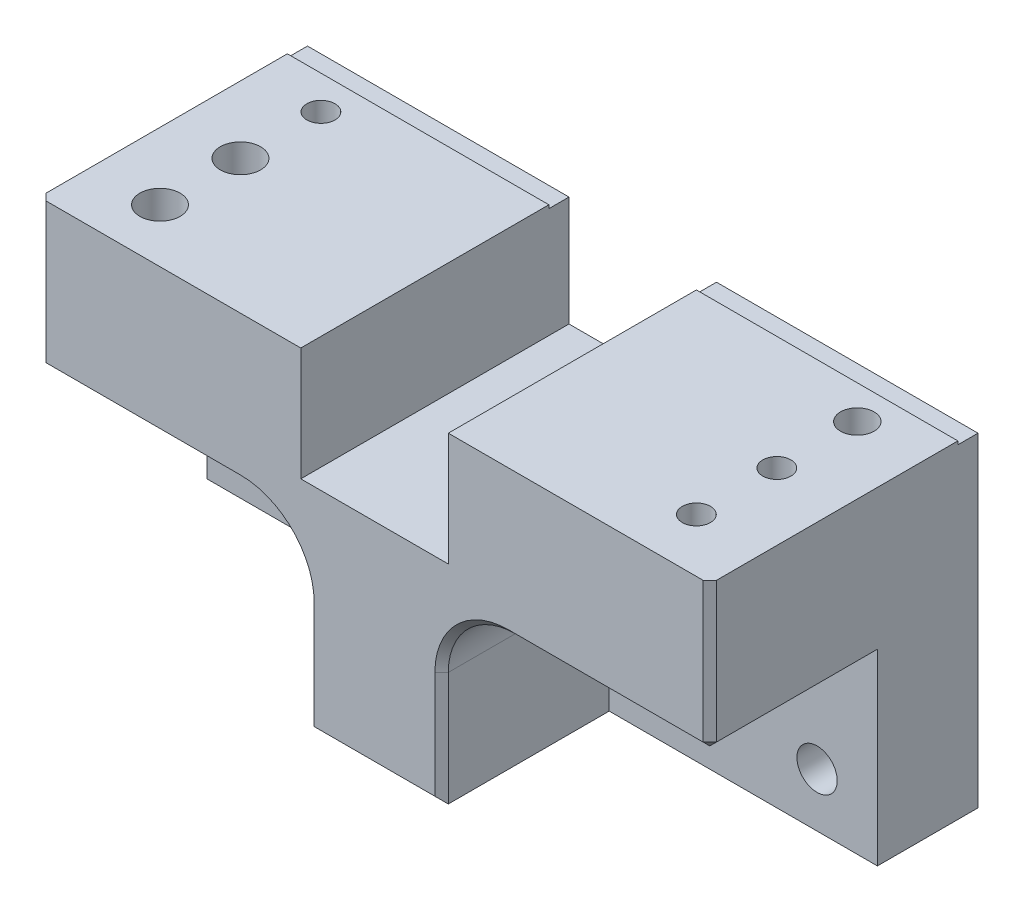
from build123d import *

# Parameters (mm, degrees)
EXTRUSION1_DEPTH                                = 40
ESQUISSE2_R                                     = 3.004
ESQUISSE2_R_2                                   = 2.5035
ENL_V_MAT_EXTRU_1_DEPTH                         = 15
TROU_TARAUD_M5X0_81_D                           = 4.2
TROU_TARAUD_M5X0_81_DEPTH                       = 12.4
TROU_TARAUD_M5X0_81_TIP                         = 1.2618073
ENL_V_MAT_EXTRU_2_DEPTH                         = 25
ESQUISSE5_W                                     = 100
ESQUISSE5_H                                     = 3
ENL_V_MAT_EXTRU_3_DEPTH                         = 0.5
ESQUISSE6_R                                     = 3.004
ENL_V_MAT_EXTRU_4_DEPTH                         = 75.271192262
CHAMBRAGE_POUR_VIS_T_TE_CYLINDRIQUE_D           = 5.5
CHAMBRAGE_POUR_VIS_T_TE_CYLINDRIQUE_CBORE_D     = 10
CHAMBRAGE_POUR_VIS_T_TE_CYLINDRIQUE_CBORE_DEPTH = 5
CHANFREIN1_SIZE                                 = 1


with BuildPart() as part:
    # Esquisse1 → Extrusion1 (new body)
    with BuildSketch(Plane.XY):
        Polygon((-50, 48.9), (-11, 48.9), (-11, 32), (11, 32), (11, 48.9), (50, 48.9), (50, 0), (-50, 0), align=None)
    extrude(amount=EXTRUSION1_DEPTH)

    # Esquisse2 → Enl_v. mat.-Extru.1 (cut)
    with BuildSketch(Plane(origin=(0, 48.9, 0), x_dir=(-1, 0, 0), z_dir=(0, 1, 0))):
        with Locations((40, 32)):
            Circle(ESQUISSE2_R)
        with Locations((-40, 8)):
            Circle(ESQUISSE2_R_2)
        with Locations((40, 20)):
            Circle(ESQUISSE2_R)
    extrude(amount=-ENL_V_MAT_EXTRU_1_DEPTH, mode=Mode.SUBTRACT)

    # Trou taraud_ M5x0.81
    with Locations(Plane(origin=(-40, 48.9, 8), x_dir=(0, 0, 1), z_dir=(0, 1, 0))):
        with Locations((0, 0), (24, 80), (12, 80)):
            Hole(TROU_TARAUD_M5X0_81_D / 2, depth=TROU_TARAUD_M5X0_81_DEPTH)
            with Locations((0, 0, -(TROU_TARAUD_M5X0_81_DEPTH + TROU_TARAUD_M5X0_81_TIP / 2))):  # 118° drill point
                Cone(0, TROU_TARAUD_M5X0_81_D / 2, TROU_TARAUD_M5X0_81_TIP, mode=Mode.SUBTRACT)

    # Esquisse4 → Enl_v. mat.-Extru.2 (cut)
    with BuildSketch(Plane.XY.offset(40)):
        with BuildLine():
            Line((-50, 27), (-20, 27))
            ThreePointArc((-20, 27), (-12.928932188, 24.071067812), (-10, 17))
            Line((-10, 17), (-10, 0))
            Line((-10, 0), (-50, 0))
            Line((-50, 0), (-50, 27))
        make_face()
        with BuildLine():
            Line((10, 17), (10, 0))
            Line((10, 0), (50, 0))
            Line((50, 0), (50, 27))
            Line((50, 27), (20, 27))
            ThreePointArc((20, 27), (12.928932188, 24.071067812), (10, 17))
        make_face()
    extrude(amount=-ENL_V_MAT_EXTRU_2_DEPTH, mode=Mode.SUBTRACT)

    # Esquisse5 → Enl_v. mat.-Extru.3 (cut)
    with BuildSketch(Plane(origin=(0, 48.9, 0), x_dir=(-1, 0, 0), z_dir=(0, 1, 0))):
        with Locations((0, 1.5)):
            Rectangle(ESQUISSE5_W, ESQUISSE5_H)
    extrude(amount=-ENL_V_MAT_EXTRU_3_DEPTH, mode=Mode.SUBTRACT)

    # Esquisse6 → Enl_v. mat.-Extru.4 (cut, through all)
    with BuildSketch(Plane.XY.offset(15)):
        with Locations((41, 8)):
            Circle(ESQUISSE6_R)
        with Locations((-41, 8)):
            Circle(ESQUISSE6_R)
    extrude(amount=-ENL_V_MAT_EXTRU_4_DEPTH, mode=Mode.SUBTRACT)

    # Chambrage pour vis _ t_te cylindrique (through all)
    with Locations(Plane.XY.offset(15)):
        with Locations((20, 17), (-20, 17)):
            CounterBoreHole(CHAMBRAGE_POUR_VIS_T_TE_CYLINDRIQUE_D / 2, CHAMBRAGE_POUR_VIS_T_TE_CYLINDRIQUE_CBORE_D / 2, CHAMBRAGE_POUR_VIS_T_TE_CYLINDRIQUE_CBORE_DEPTH)

    # Chanfrein1
    chanfrein1_edges = [part.edges().sort_by_distance(p)[0] for p in [
        (-50, 37.95, 40),
        (50, 37.95, 40),
        (50, 27, 27.5),
        (35, 27, 40),
        (12.928932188, 24.071067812, 40),
        (10, 8.5, 40),
        (0, 0, 40),
        (-50, 27, 27.5),
        (-10, 8.5, 40),
        (-12.928932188, 24.071067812, 40),
        (-35, 27, 40),
    ]]
    chamfer(chanfrein1_edges, length=CHANFREIN1_SIZE)


solid = part.part
